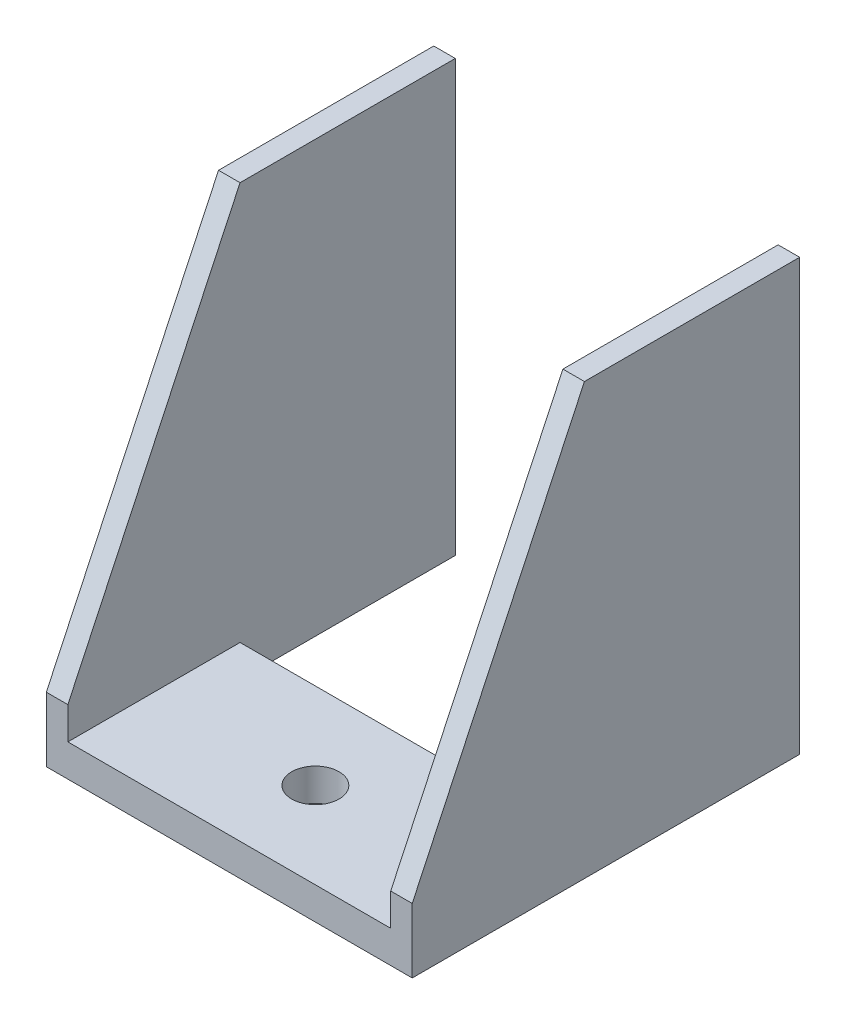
from build123d import *

# Parameters (mm, degrees)
SKETCH2_W           = 150
SKETCH2_H           = 80
SKETCH2_R           = 11
BOSS_EXTRUDE1_DEPTH = 15
BOSS_EXTRUDE2_DEPTH = 10


with BuildPart() as part:
    # Sketch2 → Boss-Extrude1 (new body)
    with BuildSketch(Plane(origin=(0, 0, 0), x_dir=(1, 0, 0), z_dir=(0, 1, 0))):
        Rectangle(SKETCH2_W, SKETCH2_H)
        with Locations(Location((0, 0, 0), (0, 0, 270))):
            Circle(SKETCH2_R, mode=Mode.SUBTRACT)
    extrude(amount=BOSS_EXTRUDE1_DEPTH)

    # Sketch3 → Boss-Extrude2 (add)
    with BuildSketch(Plane(origin=(75, 0, 0), x_dir=(0, 0, -1), z_dir=(1, 0, 0))):
        Polygon((140, 0), (140, 200), (40, 200), (-40, 30), (-40, 0), align=None)
    boss_extrude2 = extrude(amount=BOSS_EXTRUDE2_DEPTH)

    # Mirror1: Boss-Extrude2 across plane
    add(boss_extrude2.mirror(Plane(origin=(0, 0, 0), x_dir=(0, 0, 1), z_dir=(1, 0, 0))))


solid = part.part
